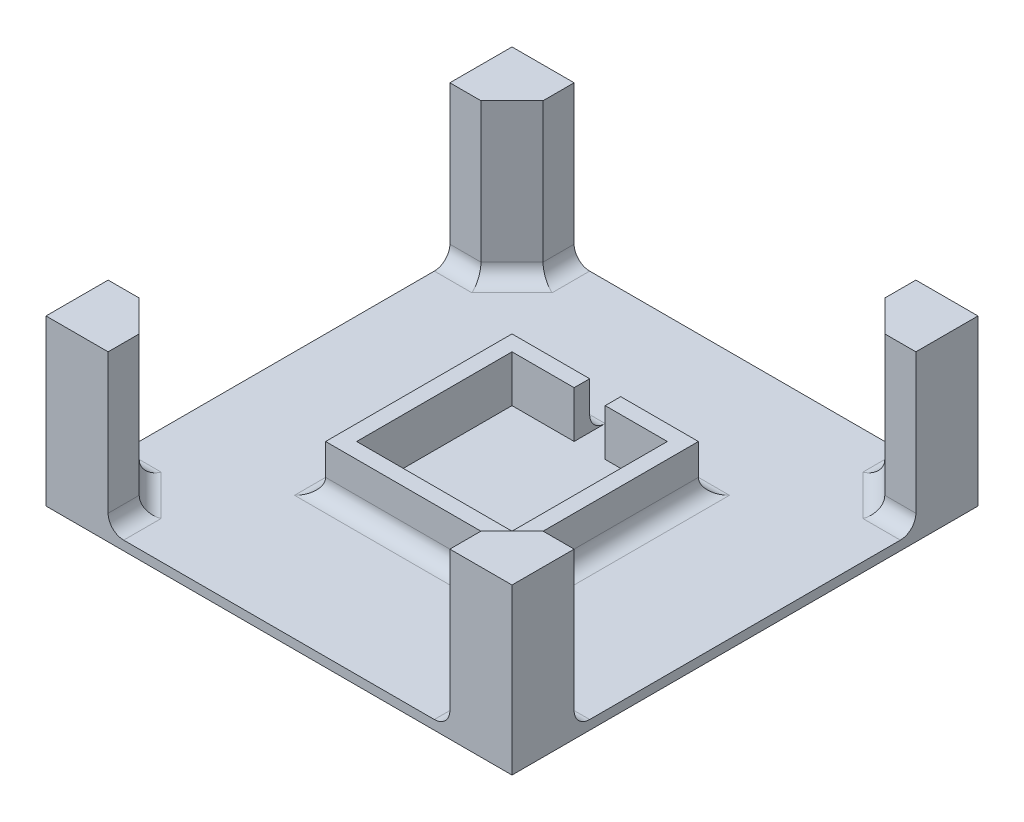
from build123d import *

# Parameters (mm, degrees)
CROQUIS1_W              = 150
CROQUIS1_H              = 150
SALIENTE_EXTRUIR1_DEPTH = 1.5
SALIENTE_EXTRUIR2_DEPTH = 50
CROQUIS4_W              = 60
CROQUIS4_H              = 60
CROQUIS4_W_2            = 50
CROQUIS4_H_2            = 50
SALIENTE_EXTRUIR3_DEPTH = 15
CORTAR_EXTRUIR1_REACH   = 140.933
CROQUIS5_W              = 10
CROQUIS5_H              = 15
REDONDEO2_R             = 5
REDONDEO3_R             = 5
REDONDEO4_R             = 5
REDONDEO5_R             = 5
REDONDEO6_R             = 5


with BuildPart() as part:
    # Croquis1 → Saliente-Extruir1 (new, symmetric)
    with BuildSketch(Plane(origin=(0, 0, 0), x_dir=(1, 0, 0), z_dir=(0, 1, 0))):
        Rectangle(CROQUIS1_W, CROQUIS1_H)
    extrude(amount=SALIENTE_EXTRUIR1_DEPTH, both=True)

    # Croquis2 → Saliente-Extruir2 (add)
    with BuildSketch(Plane(origin=(0, 1.5, 0), x_dir=(1, 0, 0), z_dir=(0, 1, 0))):
        Polygon((-75, 75), (-75, 55), (-65, 55), (-55, 65), (-55, 75), align=None)
        Polygon((75, 75), (55, 75), (55, 65), (65, 55), (75, 55), align=None)
        Polygon((55, -65), (55, -75), (75, -75), (75, -55), (65, -55), align=None)
        Polygon((-65, -55), (-55, -65), (-55, -75), (-75, -75), (-75, -55), align=None)
    extrude(amount=SALIENTE_EXTRUIR2_DEPTH)

    # Croquis4 → Saliente-Extruir3 (add)
    with BuildSketch(Plane(origin=(0, 1.5, 0), x_dir=(1, 0, 0), z_dir=(0, 1, 0))):
        Rectangle(CROQUIS4_W, CROQUIS4_H)
        Rectangle(CROQUIS4_W_2, CROQUIS4_H_2, mode=Mode.SUBTRACT)
    extrude(amount=SALIENTE_EXTRUIR3_DEPTH)

    # Croquis5 → Cortar-Extruir1 (cut, up to next)
    with BuildSketch(Plane(origin=(0, 0, -30), x_dir=(-1, 0, 0), z_dir=(0, 0, -1)), mode=Mode.PRIVATE) as cortar_extruir1_sk1:
        with Locations((0, 9)):
            Rectangle(CROQUIS5_W, CROQUIS5_H)
    cortar_extruir1_tool1 = extrude(cortar_extruir1_sk1.sketch, amount=-CORTAR_EXTRUIR1_REACH, mode=Mode.PRIVATE) & part.part
    add(cortar_extruir1_tool1.solids().sort_by_distance((0, 9, -30))[0], mode=Mode.SUBTRACT)

    # Redondeo2
    redondeo2_edges = [part.edges().sort_by_distance(p)[0] for p in [
        (-70, 1.5, -55),
        (-60, 1.5, -60),
        (-55, 1.5, -70),
    ]]
    fillet(redondeo2_edges, radius=REDONDEO2_R)

    # Redondeo3
    redondeo3_edges = [part.edges().sort_by_distance(p)[0] for p in [
        (55, 1.5, -70),
        (70, 1.5, -55),
        (60, 1.5, -60),
    ]]
    fillet(redondeo3_edges, radius=REDONDEO3_R)

    # Redondeo4
    redondeo4_edges = [part.edges().sort_by_distance(p)[0] for p in [
        (-70, 1.5, 55),
        (-60, 1.5, 60),
        (-55, 1.5, 70),
    ]]
    fillet(redondeo4_edges, radius=REDONDEO4_R)

    # Redondeo5
    redondeo5_edges = [part.edges().sort_by_distance(p)[0] for p in [
        (70, 1.5, 55),
        (60, 1.5, 60),
        (55, 1.5, 70),
    ]]
    fillet(redondeo5_edges, radius=REDONDEO5_R)

    # Redondeo6
    redondeo6_edges = [part.edges().sort_by_distance(p)[0] for p in [
        (-17.5, 1.5, -30),
        (-30, 1.5, 0),
        (0, 1.5, 30),
        (30, 1.5, 0),
        (17.5, 1.5, -30),
    ]]
    fillet(redondeo6_edges, radius=REDONDEO6_R)


solid = part.part
